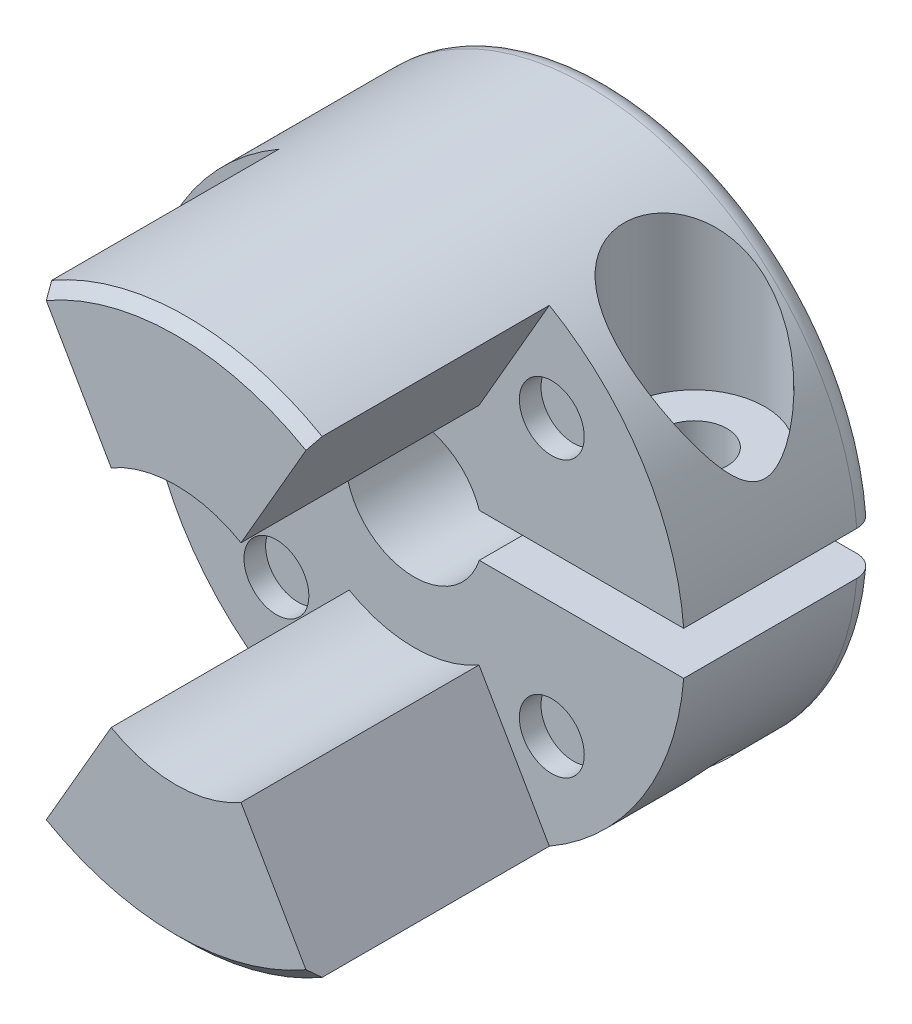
ISO-10303-21;
HEADER;
FILE_DESCRIPTION(('STEP AP214'),'2;1');
FILE_NAME('part.step','',(''),(''),'','','');
FILE_SCHEMA(('AUTOMOTIVE_DESIGN { 1 0 10303 214 1 1 1 1 }'));
ENDSEC;
DATA;
#1=APPLICATION_CONTEXT('core data for automotive mechanical design processes');
#2=APPLICATION_PROTOCOL_DEFINITION('international standard','automotive_design',2000,#1);
#3=PRODUCT_CONTEXT('',#1,'mechanical');
#4=PRODUCT('Part','Part','',(#3));
#5=PRODUCT_RELATED_PRODUCT_CATEGORY('part','',(#4));
#6=PRODUCT_DEFINITION_FORMATION('','',#4);
#7=PRODUCT_DEFINITION_CONTEXT('part definition',#1,'design');
#8=PRODUCT_DEFINITION('design','',#6,#7);
#9=PRODUCT_DEFINITION_SHAPE('','',#8);
#10=(LENGTH_UNIT() NAMED_UNIT(*) SI_UNIT(.MILLI.,.METRE.));
#11=(NAMED_UNIT(*) PLANE_ANGLE_UNIT() SI_UNIT($,.RADIAN.));
#12=(NAMED_UNIT(*) SI_UNIT($,.STERADIAN.) SOLID_ANGLE_UNIT());
#13=UNCERTAINTY_MEASURE_WITH_UNIT(LENGTH_MEASURE(1.E-05),#10,'distance_accuracy_value','');
#14=(GEOMETRIC_REPRESENTATION_CONTEXT(3) GLOBAL_UNCERTAINTY_ASSIGNED_CONTEXT((#13)) GLOBAL_UNIT_ASSIGNED_CONTEXT((#10,
#11,#12)) REPRESENTATION_CONTEXT('',''));
#15=CARTESIAN_POINT('',(0.,0.,0.));
#16=DIRECTION('',(0.,0.,1.));
#17=DIRECTION('',(1.,0.,0.));
#18=AXIS2_PLACEMENT_3D('',#15,#16,#17);
#19=CARTESIAN_POINT('',(8.45993579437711,4.,4.5));
#20=DIRECTION('',(0.,-1.,0.));
#21=DIRECTION('',(0.,0.,-1.));
#22=AXIS2_PLACEMENT_3D('',#19,#20,#21);
#23=PLANE('',#22);
#24=CARTESIAN_POINT('',(8.45993579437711,4.,4.5));
#25=DIRECTION('',(0.,-1.,0.));
#26=DIRECTION('',(0.,0.,-1.));
#27=AXIS2_PLACEMENT_3D('',#24,#25,#26);
#28=CIRCLE('',#27,3.25);
#29=CARTESIAN_POINT('',(8.45993579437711,4.,1.25));
#30=VERTEX_POINT('',#29);
#31=EDGE_CURVE('E476',#30,#30,#28,.F.);
#32=ORIENTED_EDGE('',*,*,#31,.T.);
#33=EDGE_LOOP('',(#32));
#34=FACE_BOUND('',#33,.T.);
#35=CARTESIAN_POINT('',(8.45993579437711,4.,4.5));
#36=DIRECTION('',(0.,1.,0.));
#37=DIRECTION('',(0.,0.,1.));
#38=AXIS2_PLACEMENT_3D('',#35,#36,#37);
#39=CIRCLE('',#38,1.5);
#40=CARTESIAN_POINT('',(8.45993579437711,4.,6.));
#41=VERTEX_POINT('',#40);
#42=EDGE_CURVE('E20',#41,#41,#39,.F.);
#43=ORIENTED_EDGE('',*,*,#42,.T.);
#44=EDGE_LOOP('',(#43));
#45=FACE_BOUND('',#44,.T.);
#46=ADVANCED_FACE('F17',(#34,#45),#23,.F.);
#47=CARTESIAN_POINT('',(6.36396103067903,6.36396103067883,8.));
#48=DIRECTION('',(0.,0.,1.));
#49=DIRECTION('',(1.,0.,0.));
#50=AXIS2_PLACEMENT_3D('',#47,#48,#49);
#51=PLANE('',#50);
#52=CARTESIAN_POINT('',(6.36396103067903,6.36396103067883,8.));
#53=DIRECTION('',(0.,0.,1.));
#54=DIRECTION('',(1.,0.,0.));
#55=AXIS2_PLACEMENT_3D('',#52,#53,#54);
#56=CIRCLE('',#55,1.5);
#57=CARTESIAN_POINT('',(7.86396103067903,6.36396103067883,8.));
#58=VERTEX_POINT('',#57);
#59=EDGE_CURVE('E713',#58,#58,#56,.T.);
#60=ORIENTED_EDGE('',*,*,#59,.T.);
#61=EDGE_LOOP('',(#60));
#62=FACE_BOUND('',#61,.T.);
#63=ADVANCED_FACE('F525',(#62),#51,.T.);
#64=CARTESIAN_POINT('',(-6.36396103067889,6.36396103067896,8.));
#65=DIRECTION('',(0.,0.,1.));
#66=DIRECTION('',(1.,0.,0.));
#67=AXIS2_PLACEMENT_3D('',#64,#65,#66);
#68=PLANE('',#67);
#69=CARTESIAN_POINT('',(-6.36396103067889,6.36396103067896,8.));
#70=DIRECTION('',(0.,0.,1.));
#71=DIRECTION('',(1.,0.,0.));
#72=AXIS2_PLACEMENT_3D('',#69,#70,#71);
#73=CIRCLE('',#72,1.5);
#74=CARTESIAN_POINT('',(-4.86396103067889,6.36396103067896,8.));
#75=VERTEX_POINT('',#74);
#76=EDGE_CURVE('E710',#75,#75,#73,.T.);
#77=ORIENTED_EDGE('',*,*,#76,.T.);
#78=EDGE_LOOP('',(#77));
#79=FACE_BOUND('',#78,.T.);
#80=ADVANCED_FACE('F518',(#79),#68,.T.);
#81=CARTESIAN_POINT('',(-6.36396103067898,-6.36396103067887,8.));
#82=DIRECTION('',(0.,0.,1.));
#83=DIRECTION('',(1.,0.,0.));
#84=AXIS2_PLACEMENT_3D('',#81,#82,#83);
#85=PLANE('',#84);
#86=CARTESIAN_POINT('',(-6.36396103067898,-6.36396103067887,8.));
#87=DIRECTION('',(0.,0.,1.));
#88=DIRECTION('',(1.,0.,0.));
#89=AXIS2_PLACEMENT_3D('',#86,#87,#88);
#90=CIRCLE('',#89,1.5);
#91=CARTESIAN_POINT('',(-4.86396103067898,-6.36396103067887,8.));
#92=VERTEX_POINT('',#91);
#93=EDGE_CURVE('E705',#92,#92,#90,.T.);
#94=ORIENTED_EDGE('',*,*,#93,.T.);
#95=EDGE_LOOP('',(#94));
#96=FACE_BOUND('',#95,.T.);
#97=ADVANCED_FACE('F511',(#96),#85,.T.);
#98=CARTESIAN_POINT('',(8.45993579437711,-12.501,4.5));
#99=DIRECTION('',(0.,1.,0.));
#100=DIRECTION('',(0.,0.,1.));
#101=AXIS2_PLACEMENT_3D('',#98,#99,#100);
#102=CYLINDRICAL_SURFACE('',#101,1.5);
#103=ORIENTED_EDGE('',*,*,#42,.F.);
#104=EDGE_LOOP('',(#103));
#105=FACE_BOUND('',#104,.T.);
#106=CARTESIAN_POINT('',(8.45993579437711,1.,4.5));
#107=DIRECTION('',(0.,1.,0.));
#108=DIRECTION('',(0.,0.,1.));
#109=AXIS2_PLACEMENT_3D('',#106,#107,#108);
#110=CIRCLE('',#109,1.5);
#111=CARTESIAN_POINT('',(8.45993579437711,1.,6.));
#112=VERTEX_POINT('',#111);
#113=EDGE_CURVE('E170',#112,#112,#110,.F.);
#114=ORIENTED_EDGE('',*,*,#113,.T.);
#115=EDGE_LOOP('',(#114));
#116=FACE_BOUND('',#115,.T.);
#117=ADVANCED_FACE('F306',(#105,#116),#102,.F.);
#118=CARTESIAN_POINT('',(0.,0.,0.));
#119=DIRECTION('',(0.,0.,-1.));
#120=DIRECTION('',(-1.,0.,0.));
#121=AXIS2_PLACEMENT_3D('',#118,#119,#120);
#122=CONICAL_SURFACE('',#121,3.67499999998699,0.785398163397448);
#123=CARTESIAN_POINT('',(0.,0.,0.500000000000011));
#124=DIRECTION('',(0.,0.,-1.));
#125=DIRECTION('',(-1.,0.,0.));
#126=AXIS2_PLACEMENT_3D('',#123,#124,#125);
#127=CIRCLE('',#126,3.175);
#128=CARTESIAN_POINT('',(3.01340753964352,1.,0.499999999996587));
#129=VERTEX_POINT('',#128);
#130=CARTESIAN_POINT('',(3.01340753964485,-1.,0.499999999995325));
#131=VERTEX_POINT('',#130);
#132=EDGE_CURVE('E145',#129,#131,#127,.F.);
#133=ORIENTED_EDGE('',*,*,#132,.T.);
#134=CARTESIAN_POINT('',(3.53632931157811,-1.,-3.00490254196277E-12));
#135=CARTESIAN_POINT('',(3.44946066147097,-1.,0.08363133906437));
#136=CARTESIAN_POINT('',(3.36244953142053,-1.,0.167113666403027));
#137=CARTESIAN_POINT('',(3.18814227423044,-1.,0.33378033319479));
#138=CARTESIAN_POINT('',(3.10084614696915,-1.,0.416964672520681));
#139=CARTESIAN_POINT('',(3.01340753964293,-1.,0.499999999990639));
#140=B_SPLINE_CURVE_WITH_KNOTS('',3,(#134,#135,#136,#137,#138,#139),.UNSPECIFIED.,.F.,.F.,(4,2,
4),(0.,0.361748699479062,0.723497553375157),.UNSPECIFIED.);
#141=CARTESIAN_POINT('',(3.53632931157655,-1.,-1.50251848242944E-12));
#142=VERTEX_POINT('',#141);
#143=EDGE_CURVE('E133',#142,#131,#140,.T.);
#144=ORIENTED_EDGE('',*,*,#143,.F.);
#145=CARTESIAN_POINT('',(0.,0.,0.));
#146=DIRECTION('',(0.,0.,-1.));
#147=DIRECTION('',(-1.,0.,0.));
#148=AXIS2_PLACEMENT_3D('',#145,#146,#147);
#149=CIRCLE('',#148,3.67499999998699);
#150=CARTESIAN_POINT('',(3.53632931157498,1.,0.));
#151=VERTEX_POINT('',#150);
#152=EDGE_CURVE('E127',#142,#151,#149,.T.);
#153=ORIENTED_EDGE('',*,*,#152,.T.);
#154=CARTESIAN_POINT('',(3.53632931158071,1.,-5.50815606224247E-12));
#155=CARTESIAN_POINT('',(3.4494606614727,1.,0.0836313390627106));
#156=CARTESIAN_POINT('',(3.36244953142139,1.,0.167113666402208));
#157=CARTESIAN_POINT('',(3.18814227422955,1.,0.333780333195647));
#158=CARTESIAN_POINT('',(3.10084614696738,1.,0.416964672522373));
#159=CARTESIAN_POINT('',(3.01340753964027,1.,0.499999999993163));
#160=B_SPLINE_CURVE_WITH_KNOTS('',3,(#154,#155,#156,#157,#158,#159),.UNSPECIFIED.,.F.,.F.,(4,2,
4),(0.,0.361748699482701,0.723497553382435),.UNSPECIFIED.);
#161=EDGE_CURVE('E148',#151,#129,#160,.T.);
#162=ORIENTED_EDGE('',*,*,#161,.T.);
#163=EDGE_LOOP('',(#133,#144,#153,#162));
#164=FACE_BOUND('',#163,.T.);
#165=ADVANCED_FACE('F146',(#164),#122,.F.);
#166=CARTESIAN_POINT('',(0.,0.,20.));
#167=DIRECTION('',(0.,0.,1.));
#168=DIRECTION('',(1.,0.,0.));
#169=AXIS2_PLACEMENT_3D('',#166,#167,#168);
#170=PLANE('',#169);
#171=CARTESIAN_POINT('',(0.,0.,20.));
#172=DIRECTION('',(0.,0.,-1.));
#173=DIRECTION('',(-1.,0.,0.));
#174=AXIS2_PLACEMENT_3D('',#171,#172,#173);
#175=CIRCLE('',#174,12.);
#176=CARTESIAN_POINT('',(-6.00000000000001,10.3923048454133,20.));
#177=VERTEX_POINT('',#176);
#178=CARTESIAN_POINT('',(6.00000000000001,10.3923048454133,20.));
#179=VERTEX_POINT('',#178);
#180=EDGE_CURVE('E143',#177,#179,#175,.T.);
#181=ORIENTED_EDGE('',*,*,#180,.F.);
#182=DIRECTION('',(0.500000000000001,-0.866025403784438,0.));
#183=VECTOR('',#182,1.);
#184=CARTESIAN_POINT('',(0.,0.,20.));
#185=LINE('',#184,#183);
#186=CARTESIAN_POINT('',(-3.,5.19615242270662,20.));
#187=VERTEX_POINT('',#186);
#188=EDGE_CURVE('E152',#187,#177,#185,.F.);
#189=ORIENTED_EDGE('',*,*,#188,.F.);
#190=CARTESIAN_POINT('',(0.,0.,20.));
#191=DIRECTION('',(0.,0.,1.));
#192=DIRECTION('',(1.,0.,0.));
#193=AXIS2_PLACEMENT_3D('',#190,#191,#192);
#194=CIRCLE('',#193,6.);
#195=CARTESIAN_POINT('',(3.,5.19615242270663,20.));
#196=VERTEX_POINT('',#195);
#197=EDGE_CURVE('E299',#187,#196,#194,.F.);
#198=ORIENTED_EDGE('',*,*,#197,.T.);
#199=DIRECTION('',(-0.500000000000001,-0.866025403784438,0.));
#200=VECTOR('',#199,1.);
#201=CARTESIAN_POINT('',(0.,0.,20.));
#202=LINE('',#201,#200);
#203=EDGE_CURVE('E386',#196,#179,#202,.F.);
#204=ORIENTED_EDGE('',*,*,#203,.T.);
#205=EDGE_LOOP('',(#181,#189,#198,#204));
#206=FACE_BOUND('',#205,.T.);
#207=ADVANCED_FACE('F305',(#206),#170,.T.);
#208=CARTESIAN_POINT('',(6.36396103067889,-6.36396103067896,8.));
#209=DIRECTION('',(0.,0.,1.));
#210=DIRECTION('',(1.,0.,0.));
#211=AXIS2_PLACEMENT_3D('',#208,#209,#210);
#212=PLANE('',#211);
#213=CARTESIAN_POINT('',(6.36396103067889,-6.36396103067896,8.));
#214=DIRECTION('',(0.,0.,1.));
#215=DIRECTION('',(1.,0.,0.));
#216=AXIS2_PLACEMENT_3D('',#213,#214,#215);
#217=CIRCLE('',#216,1.5);
#218=CARTESIAN_POINT('',(7.86396103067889,-6.36396103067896,8.));
#219=VERTEX_POINT('',#218);
#220=EDGE_CURVE('E397',#219,#219,#217,.T.);
#221=ORIENTED_EDGE('',*,*,#220,.T.);
#222=EDGE_LOOP('',(#221));
#223=FACE_BOUND('',#222,.T.);
#224=ADVANCED_FACE('F490',(#223),#212,.T.);
#225=CARTESIAN_POINT('',(0.,0.,19.5));
#226=DIRECTION('',(0.,0.,-1.));
#227=DIRECTION('',(-1.,0.,0.));
#228=AXIS2_PLACEMENT_3D('',#225,#226,#227);
#229=CONICAL_SURFACE('',#228,12.5,0.785398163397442);
#230=DIRECTION('',(-0.353553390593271,0.612372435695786,-0.707106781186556));
#231=VECTOR('',#230,1.);
#232=CARTESIAN_POINT('',(-6.00000000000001,10.3923048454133,20.));
#233=LINE('',#232,#231);
#234=CARTESIAN_POINT('',(-6.25000000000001,10.8253175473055,19.5));
#235=VERTEX_POINT('',#234);
#236=EDGE_CURVE('E390',#177,#235,#233,.T.);
#237=ORIENTED_EDGE('',*,*,#236,.F.);
#238=ORIENTED_EDGE('',*,*,#180,.T.);
#239=DIRECTION('',(0.353553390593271,0.612372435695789,-0.707106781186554));
#240=VECTOR('',#239,1.);
#241=CARTESIAN_POINT('',(6.00000000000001,10.3923048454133,20.));
#242=LINE('',#241,#240);
#243=CARTESIAN_POINT('',(6.25000000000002,10.8253175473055,19.5));
#244=VERTEX_POINT('',#243);
#245=EDGE_CURVE('E387',#179,#244,#242,.T.);
#246=ORIENTED_EDGE('',*,*,#245,.T.);
#247=CARTESIAN_POINT('',(0.,0.,19.5));
#248=DIRECTION('',(0.,0.,-1.));
#249=DIRECTION('',(-1.,0.,0.));
#250=AXIS2_PLACEMENT_3D('',#247,#248,#249);
#251=CIRCLE('',#250,12.5);
#252=EDGE_CURVE('E176',#235,#244,#251,.T.);
#253=ORIENTED_EDGE('',*,*,#252,.F.);
#254=EDGE_LOOP('',(#237,#238,#246,#253));
#255=FACE_BOUND('',#254,.T.);
#256=ADVANCED_FACE('F206',(#255),#229,.T.);
#257=CARTESIAN_POINT('',(8.45993579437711,12.5,4.5));
#258=DIRECTION('',(0.,-1.,0.));
#259=DIRECTION('',(0.,0.,-1.));
#260=AXIS2_PLACEMENT_3D('',#257,#258,#259);
#261=CYLINDRICAL_SURFACE('',#260,3.25);
#262=ORIENTED_EDGE('',*,*,#31,.F.);
#263=EDGE_LOOP('',(#262));
#264=FACE_BOUND('',#263,.T.);
#265=CARTESIAN_POINT('',(8.45993579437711,9.20214574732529,7.75));
#266=CARTESIAN_POINT('',(8.35821897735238,9.29565821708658,7.74999972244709));
#267=CARTESIAN_POINT('',(8.25494097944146,9.38748858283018,7.74522625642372));
#268=CARTESIAN_POINT('',(8.04598618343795,9.56718824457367,7.72523800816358));
#269=CARTESIAN_POINT('',(7.94030986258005,9.65505831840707,7.71002528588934));
#270=CARTESIAN_POINT('',(7.72749590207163,9.82621121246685,7.66824494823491));
#271=CARTESIAN_POINT('',(7.62035868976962,9.9094953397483,7.64168058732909));
#272=CARTESIAN_POINT('',(7.40591408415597,10.0707730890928,7.57638048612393));
#273=CARTESIAN_POINT('',(7.29860678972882,10.1487690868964,7.53765025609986));
#274=CARTESIAN_POINT('',(7.03686498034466,10.3328714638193,7.42670784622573));
#275=CARTESIAN_POINT('',(6.88305827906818,10.4357437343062,7.34727475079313));
#276=CARTESIAN_POINT('',(6.65895554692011,10.5790490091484,7.20680258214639));
#277=CARTESIAN_POINT('',(6.5853393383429,10.624993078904,7.15641042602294));
#278=CARTESIAN_POINT('',(6.44110431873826,10.7130425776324,7.04851214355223));
#279=CARTESIAN_POINT('',(6.37048409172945,10.7551498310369,6.9910094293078));
#280=CARTESIAN_POINT('',(6.2326296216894,10.8356242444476,6.86857922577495));
#281=CARTESIAN_POINT('',(6.16542240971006,10.8739632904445,6.80360277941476));
#282=CARTESIAN_POINT('',(6.03586823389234,10.9464057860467,6.66685512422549));
#283=CARTESIAN_POINT('',(5.97351904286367,10.9805111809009,6.5950870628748));
#284=CARTESIAN_POINT('',(5.85454810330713,11.0444026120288,6.44515148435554));
#285=CARTESIAN_POINT('',(5.79792661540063,11.0741884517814,6.36698367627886));
#286=CARTESIAN_POINT('',(5.69127349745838,11.1293761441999,6.204823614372));
#287=CARTESIAN_POINT('',(5.64124110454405,11.1547785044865,6.12083203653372));
#288=CARTESIAN_POINT('',(5.55353632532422,11.1986773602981,5.95705817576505));
#289=CARTESIAN_POINT('',(5.51511306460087,11.217623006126,5.87779716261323));
#290=CARTESIAN_POINT('',(5.44459450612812,11.2520189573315,5.71574190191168));
#291=CARTESIAN_POINT('',(5.41250132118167,11.2674680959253,5.63294648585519));
#292=CARTESIAN_POINT('',(5.3550891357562,11.2948676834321,5.46453697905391));
#293=CARTESIAN_POINT('',(5.32976537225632,11.3068205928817,5.37892491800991));
#294=CARTESIAN_POINT('',(5.28617367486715,11.3272651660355,5.20551016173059));
#295=CARTESIAN_POINT('',(5.26790825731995,11.3357555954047,5.11770669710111));
#296=CARTESIAN_POINT('',(5.22590123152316,11.3552171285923,4.86302109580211));
#297=CARTESIAN_POINT('',(5.21135213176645,11.3618584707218,4.69416884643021));
#298=CARTESIAN_POINT('',(5.2087155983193,11.3630659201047,4.35632654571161));
#299=CARTESIAN_POINT('',(5.22062360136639,11.3576341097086,4.18733652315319));
#300=CARTESIAN_POINT('',(5.26993344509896,11.3348363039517,3.85667080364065));
#301=CARTESIAN_POINT('',(5.30693134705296,11.3176593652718,3.69492186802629));
#302=CARTESIAN_POINT('',(5.40440504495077,11.2714369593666,3.38047669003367));
#303=CARTESIAN_POINT('',(5.46488016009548,11.2423918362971,3.22778018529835));
#304=CARTESIAN_POINT('',(5.60748178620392,11.1719518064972,2.93379875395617));
#305=CARTESIAN_POINT('',(5.68983896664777,11.1304246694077,2.79265770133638));
#306=CARTESIAN_POINT('',(5.87232738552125,11.0352314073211,2.52698978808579));
#307=CARTESIAN_POINT('',(5.97246015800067,10.981564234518,2.40246436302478));
#308=CARTESIAN_POINT('',(6.19121687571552,10.8597953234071,2.16711092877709));
#309=CARTESIAN_POINT('',(6.31046922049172,10.7911536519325,2.05714901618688));
#310=CARTESIAN_POINT('',(6.55909725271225,10.6418643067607,1.85905038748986));
#311=CARTESIAN_POINT('',(6.68847684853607,10.561211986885,1.77092215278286));
#312=CARTESIAN_POINT('',(6.9662448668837,10.3803453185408,1.60866526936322));
#313=CARTESIAN_POINT('',(7.11523108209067,10.2789768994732,1.5368597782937));
#314=CARTESIAN_POINT('',(7.41493103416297,10.064926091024,1.41836655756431));
#315=CARTESIAN_POINT('',(7.56564513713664,9.95224126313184,1.37168425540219));
#316=CARTESIAN_POINT('',(7.84201168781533,9.7354435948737,1.30662647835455));
#317=CARTESIAN_POINT('',(7.96797145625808,9.63265590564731,1.28501348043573));
#318=CARTESIAN_POINT('',(8.21666397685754,9.42141389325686,1.25670286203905));
#319=CARTESIAN_POINT('',(8.33939768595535,9.31296127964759,1.250000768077));
#320=CARTESIAN_POINT('',(8.58766118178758,9.08472266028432,1.24999918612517));
#321=CARTESIAN_POINT('',(8.71292132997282,8.96464646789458,1.25752267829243));
#322=CARTESIAN_POINT('',(8.95762699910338,8.72014139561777,1.28597018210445));
#323=CARTESIAN_POINT('',(9.07706884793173,8.59570984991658,1.30690254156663));
#324=CARTESIAN_POINT('',(9.30986513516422,8.34302266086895,1.36082076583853));
#325=CARTESIAN_POINT('',(9.42319713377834,8.21475529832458,1.39384799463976));
#326=CARTESIAN_POINT('',(9.6429538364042,7.95564627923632,1.47072334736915));
#327=CARTESIAN_POINT('',(9.74937946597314,7.82480497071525,1.51457001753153));
#328=CARTESIAN_POINT('',(9.98152669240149,7.52749667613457,1.62463305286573));
#329=CARTESIAN_POINT('',(10.1052088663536,7.36048832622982,1.69370251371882));
#330=CARTESIAN_POINT('',(10.3412895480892,7.0249453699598,1.84617814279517));
#331=CARTESIAN_POINT('',(10.4536815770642,6.8564099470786,1.92959246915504));
#332=CARTESIAN_POINT('',(10.6670773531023,6.51944674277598,2.11031221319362));
#333=CARTESIAN_POINT('',(10.7680781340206,6.35101900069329,2.20762123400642));
#334=CARTESIAN_POINT('',(10.9107941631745,6.10031445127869,2.36440510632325));
#335=CARTESIAN_POINT('',(10.9568902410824,6.01709226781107,2.41845305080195));
#336=CARTESIAN_POINT('',(11.0461198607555,5.85167120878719,2.53041095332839));
#337=CARTESIAN_POINT('',(11.089253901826,5.76947216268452,2.58832025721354));
#338=CARTESIAN_POINT('',(11.1715290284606,5.6084691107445,2.70699773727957));
#339=CARTESIAN_POINT('',(11.2107385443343,5.52963039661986,2.76767113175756));
#340=CARTESIAN_POINT('',(11.2860938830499,5.37415476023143,2.89354049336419));
#341=CARTESIAN_POINT('',(11.3222407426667,5.29751709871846,2.95873491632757));
#342=CARTESIAN_POINT('',(11.39108980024,5.14779839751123,3.09409127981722));
#343=CARTESIAN_POINT('',(11.4238067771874,5.07470289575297,3.16422952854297));
#344=CARTESIAN_POINT('',(11.4855505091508,4.93336129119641,3.31068412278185));
#345=CARTESIAN_POINT('',(11.5145811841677,4.86511007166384,3.38699376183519));
#346=CARTESIAN_POINT('',(11.5631833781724,4.74826365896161,3.53199378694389));
#347=CARTESIAN_POINT('',(11.5835051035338,4.69839378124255,3.59939042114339));
#348=CARTESIAN_POINT('',(11.6206651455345,4.60571730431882,3.74001017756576));
#349=CARTESIAN_POINT('',(11.6374992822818,4.56291919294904,3.81324014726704));
#350=CARTESIAN_POINT('',(11.6669140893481,4.48718124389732,3.96707654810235));
#351=CARTESIAN_POINT('',(11.6794252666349,4.45440336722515,4.04777920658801));
#352=CARTESIAN_POINT('',(11.698437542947,4.40423818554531,4.21442004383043));
#353=CARTESIAN_POINT('',(11.7049624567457,4.3867899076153,4.30033601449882));
#354=CARTESIAN_POINT('',(11.7106387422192,4.37161297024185,4.46386054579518));
#355=CARTESIAN_POINT('',(11.7105748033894,4.37178573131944,4.54124178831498));
#356=CARTESIAN_POINT('',(11.7050225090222,4.38662750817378,4.69444310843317));
#357=CARTESIAN_POINT('',(11.6995262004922,4.40131777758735,4.7702607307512));
#358=CARTESIAN_POINT('',(11.6827069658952,4.44578212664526,4.92830871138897));
#359=CARTESIAN_POINT('',(11.6706682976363,4.47739982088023,5.00992375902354));
#360=CARTESIAN_POINT('',(11.6417891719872,4.55195933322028,5.16687100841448));
#361=CARTESIAN_POINT('',(11.624937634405,4.59492726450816,5.24218818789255));
#362=CARTESIAN_POINT('',(11.589096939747,4.68454554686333,5.38063438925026));
#363=CARTESIAN_POINT('',(11.5704101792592,4.73057476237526,5.44425536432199));
#364=CARTESIAN_POINT('',(11.5304348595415,4.8271947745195,5.56710418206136));
#365=CARTESIAN_POINT('',(11.5091439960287,4.87778960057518,5.62632805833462));
#366=CARTESIAN_POINT('',(11.4642791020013,4.98232354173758,5.741057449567));
#367=CARTESIAN_POINT('',(11.440700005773,5.03626997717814,5.79655423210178));
#368=CARTESIAN_POINT('',(11.3915219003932,5.14654116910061,5.90420746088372));
#369=CARTESIAN_POINT('',(11.3659221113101,5.20286683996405,5.95636260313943));
#370=CARTESIAN_POINT('',(11.2810020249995,5.38592328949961,6.1186418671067));
#371=CARTESIAN_POINT('',(11.2181049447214,5.51597484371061,6.2231668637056));
#372=CARTESIAN_POINT('',(11.0841656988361,5.78042831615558,6.42097642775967));
#373=CARTESIAN_POINT('',(11.0131151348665,5.9148346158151,6.51424919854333));
#374=CARTESIAN_POINT('',(10.8631139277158,6.18601667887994,6.69104753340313));
#375=CARTESIAN_POINT('',(10.7841501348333,6.32279606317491,6.77455635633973));
#376=CARTESIAN_POINT('',(10.6185712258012,6.59709241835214,6.93225338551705));
#377=CARTESIAN_POINT('',(10.531955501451,6.73460944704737,7.00644084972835));
#378=CARTESIAN_POINT('',(10.341891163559,7.02339938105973,7.15264986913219));
#379=CARTESIAN_POINT('',(10.2376269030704,7.17464200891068,7.22367545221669));
#380=CARTESIAN_POINT('',(10.0199127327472,7.47568521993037,7.35395594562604));
#381=CARTESIAN_POINT('',(9.90645970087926,7.62548529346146,7.4132068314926));
#382=CARTESIAN_POINT('',(9.67104186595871,7.92190783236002,7.51865655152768));
#383=CARTESIAN_POINT('',(9.54911459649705,8.0685409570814,7.56490887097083));
#384=CARTESIAN_POINT('',(9.29672331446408,8.35809574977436,7.64320306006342));
#385=CARTESIAN_POINT('',(9.16626584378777,8.50102014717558,7.67525567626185));
#386=CARTESIAN_POINT('',(8.94007689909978,8.73742923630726,7.71568841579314));
#387=CARTESIAN_POINT('',(8.84645681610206,8.83221541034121,7.72835248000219));
#388=CARTESIAN_POINT('',(8.65569538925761,9.0192458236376,7.74551416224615));
#389=CARTESIAN_POINT('',(8.55854927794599,9.11148630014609,7.7500002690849));
#390=CARTESIAN_POINT('',(8.45993579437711,9.20214574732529,7.75));
#391=B_SPLINE_CURVE_WITH_KNOTS('',3,(#265,#266,#267,#268,#269,#270,#271,#272,#273,#274,#275,
#276,#277,#278,#279,#280,#281,#282,#283,#284,#285,#286,#287,#288,#289,#290,#291,#292,#293,#294,
#295,#296,#297,#298,#299,#300,#301,#302,#303,#304,#305,#306,#307,#308,#309,#310,#311,#312,#313,
#314,#315,#316,#317,#318,#319,#320,#321,#322,#323,#324,#325,#326,#327,#328,#329,#330,#331,#332,
#333,#334,#335,#336,#337,#338,#339,#340,#341,#342,#343,#344,#345,#346,#347,#348,#349,#350,#351,
#352,#353,#354,#355,#356,#357,#358,#359,#360,#361,#362,#363,#364,#365,#366,#367,#368,#369,#370,
#371,#372,#373,#374,#375,#376,#377,#378,#379,#380,#381,#382,#383,#384,#385,#386,#387,#388,#389,
#390),.UNSPECIFIED.,.T.,.F.,(4,2,2,2,2,2,2,2,2,2,2,2,2,2,2,2,2,2,2,2,2,2,2,2,2,2,2,2,2,2,2,2,2,
2,2,2,2,2,2,2,2,2,2,2,2,2,2,2,2,2,2,2,2,2,2,2,2,2,2,2,2,2,4),(0.,0.414407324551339,
0.828732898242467,1.24293976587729,1.65695929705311,2.25816551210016,2.55890996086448,
2.85951064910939,3.16220652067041,3.46476279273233,3.7673328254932,4.06986779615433,
4.33981172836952,4.60984560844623,4.87968898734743,5.14962847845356,5.65576212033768,
6.16180847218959,6.65989521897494,7.15796752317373,7.66151425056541,8.16510445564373,
8.69130663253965,9.21771289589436,9.7974549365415,10.3773221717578,10.8684959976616,
11.359522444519,11.879827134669,12.4004560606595,12.9228824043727,13.4452385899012,
14.1013844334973,14.757904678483,15.4145954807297,15.7427561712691,16.0708614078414,
16.3915159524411,16.7120615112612,17.0311635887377,17.3499234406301,17.6083186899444,
17.8670218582,18.1297089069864,18.3913463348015,18.6218652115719,18.8527220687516,
19.1163167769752,19.3805232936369,19.6223279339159,19.8643481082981,20.106916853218,
20.3495796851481,20.8836489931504,21.4182734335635,21.9538014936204,22.4893721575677,
23.0796701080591,23.6701694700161,24.2582022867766,24.8457893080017,25.2469889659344,
25.6487529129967),.UNSPECIFIED.);
#392=CARTESIAN_POINT('',(8.45993579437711,9.20214574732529,7.75));
#393=VERTEX_POINT('',#392);
#394=EDGE_CURVE('E181',#393,#393,#391,.T.);
#395=ORIENTED_EDGE('',*,*,#394,.F.);
#396=EDGE_LOOP('',(#395));
#397=FACE_BOUND('',#396,.T.);
#398=ADVANCED_FACE('F201',(#264,#397),#261,.F.);
#399=CARTESIAN_POINT('',(0.,0.,0.));
#400=DIRECTION('',(0.,0.,1.));
#401=DIRECTION('',(1.,0.,0.));
#402=AXIS2_PLACEMENT_3D('',#399,#400,#401);
#403=PLANE('',#402);
#404=ORIENTED_EDGE('',*,*,#152,.F.);
#405=DIRECTION('',(1.,0.,0.));
#406=VECTOR('',#405,1.);
#407=CARTESIAN_POINT('',(1.,-1.,0.));
#408=LINE('',#407,#406);
#409=CARTESIAN_POINT('',(11.4564392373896,-1.,0.));
#410=VERTEX_POINT('',#409);
#411=EDGE_CURVE('E141',#142,#410,#408,.T.);
#412=ORIENTED_EDGE('',*,*,#411,.T.);
#413=CARTESIAN_POINT('',(0.,0.,0.));
#414=DIRECTION('',(0.,0.,1.));
#415=DIRECTION('',(0.996212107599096,0.0869565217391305,0.));
#416=AXIS2_PLACEMENT_3D('',#413,#414,#415);
#417=CIRCLE('',#416,11.5);
#418=CARTESIAN_POINT('',(11.4564392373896,1.,0.));
#419=VERTEX_POINT('',#418);
#420=EDGE_CURVE('E184',#419,#410,#417,.T.);
#421=ORIENTED_EDGE('',*,*,#420,.F.);
#422=DIRECTION('',(1.,0.,0.));
#423=VECTOR('',#422,1.);
#424=CARTESIAN_POINT('',(1.,1.,0.));
#425=LINE('',#424,#423);
#426=EDGE_CURVE('E168',#419,#151,#425,.F.);
#427=ORIENTED_EDGE('',*,*,#426,.T.);
#428=EDGE_LOOP('',(#404,#412,#421,#427));
#429=FACE_BOUND('',#428,.T.);
#430=ADVANCED_FACE('F190',(#429),#403,.F.);
#431=CARTESIAN_POINT('',(6.36396103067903,6.36396103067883,8.));
#432=DIRECTION('',(0.,0.,1.));
#433=DIRECTION('',(1.,0.,0.));
#434=AXIS2_PLACEMENT_3D('',#431,#432,#433);
#435=CYLINDRICAL_SURFACE('',#434,1.5);
#436=ORIENTED_EDGE('',*,*,#59,.F.);
#437=EDGE_LOOP('',(#436));
#438=FACE_BOUND('',#437,.T.);
#439=CARTESIAN_POINT('',(6.36396103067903,6.36396103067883,9.));
#440=DIRECTION('',(0.,0.,1.));
#441=DIRECTION('',(1.,0.,0.));
#442=AXIS2_PLACEMENT_3D('',#439,#440,#441);
#443=CIRCLE('',#442,1.5);
#444=CARTESIAN_POINT('',(7.86396103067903,6.36396103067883,9.));
#445=VERTEX_POINT('',#444);
#446=EDGE_CURVE('E159',#445,#445,#443,.T.);
#447=ORIENTED_EDGE('',*,*,#446,.T.);
#448=EDGE_LOOP('',(#447));
#449=FACE_BOUND('',#448,.T.);
#450=ADVANCED_FACE('F200',(#438,#449),#435,.F.);
#451=CARTESIAN_POINT('',(-6.36396103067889,6.36396103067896,8.));
#452=DIRECTION('',(0.,0.,1.));
#453=DIRECTION('',(1.,0.,0.));
#454=AXIS2_PLACEMENT_3D('',#451,#452,#453);
#455=CYLINDRICAL_SURFACE('',#454,1.5);
#456=ORIENTED_EDGE('',*,*,#76,.F.);
#457=EDGE_LOOP('',(#456));
#458=FACE_BOUND('',#457,.T.);
#459=CARTESIAN_POINT('',(-6.36396103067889,6.36396103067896,9.));
#460=DIRECTION('',(0.,0.,1.));
#461=DIRECTION('',(1.,0.,0.));
#462=AXIS2_PLACEMENT_3D('',#459,#460,#461);
#463=CIRCLE('',#462,1.5);
#464=CARTESIAN_POINT('',(-4.86396103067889,6.36396103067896,9.));
#465=VERTEX_POINT('',#464);
#466=EDGE_CURVE('E452',#465,#465,#463,.T.);
#467=ORIENTED_EDGE('',*,*,#466,.T.);
#468=EDGE_LOOP('',(#467));
#469=FACE_BOUND('',#468,.T.);
#470=ADVANCED_FACE('F584',(#458,#469),#455,.F.);
#471=CARTESIAN_POINT('',(-6.36396103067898,-6.36396103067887,8.));
#472=DIRECTION('',(0.,0.,1.));
#473=DIRECTION('',(1.,0.,0.));
#474=AXIS2_PLACEMENT_3D('',#471,#472,#473);
#475=CYLINDRICAL_SURFACE('',#474,1.5);
#476=ORIENTED_EDGE('',*,*,#93,.F.);
#477=EDGE_LOOP('',(#476));
#478=FACE_BOUND('',#477,.T.);
#479=CARTESIAN_POINT('',(-6.36396103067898,-6.36396103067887,9.));
#480=DIRECTION('',(0.,0.,1.));
#481=DIRECTION('',(1.,0.,0.));
#482=AXIS2_PLACEMENT_3D('',#479,#480,#481);
#483=CIRCLE('',#482,1.5);
#484=CARTESIAN_POINT('',(-4.86396103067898,-6.36396103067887,9.));
#485=VERTEX_POINT('',#484);
#486=EDGE_CURVE('E448',#485,#485,#483,.T.);
#487=ORIENTED_EDGE('',*,*,#486,.T.);
#488=EDGE_LOOP('',(#487));
#489=FACE_BOUND('',#488,.T.);
#490=ADVANCED_FACE('F288',(#478,#489),#475,.F.);
#491=CARTESIAN_POINT('',(1.,1.,0.));
#492=DIRECTION('',(0.,1.,0.));
#493=DIRECTION('',(0.,0.,1.));
#494=AXIS2_PLACEMENT_3D('',#491,#492,#493);
#495=PLANE('',#494);
#496=ORIENTED_EDGE('',*,*,#161,.F.);
#497=ORIENTED_EDGE('',*,*,#426,.F.);
#498=CARTESIAN_POINT('',(12.4599357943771,1.,1.));
#499=CARTESIAN_POINT('',(12.4599356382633,1.,0.97193237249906));
#500=CARTESIAN_POINT('',(12.458749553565,1.,0.943878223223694));
#501=CARTESIAN_POINT('',(12.4540180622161,1.,0.887971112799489));
#502=CARTESIAN_POINT('',(12.4504727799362,1.,0.860118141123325));
#503=CARTESIAN_POINT('',(12.4363331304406,1.,0.777213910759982));
#504=CARTESIAN_POINT('',(12.4222348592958,1.,0.722718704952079));
#505=CARTESIAN_POINT('',(12.3850929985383,1.,0.616871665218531));
#506=CARTESIAN_POINT('',(12.3620453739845,1.,0.565521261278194));
#507=CARTESIAN_POINT('',(12.3076678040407,1.,0.467411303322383));
#508=CARTESIAN_POINT('',(12.2763391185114,1.,0.420651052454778));
#509=CARTESIAN_POINT('',(12.2062539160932,1.,0.332977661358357));
#510=CARTESIAN_POINT('',(12.1674868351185,1.,0.29207298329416));
#511=CARTESIAN_POINT('',(12.0836282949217,1.,0.217315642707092));
#512=CARTESIAN_POINT('',(12.0385367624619,1.,0.183463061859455));
#513=CARTESIAN_POINT('',(11.9670943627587,1.,0.138656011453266));
#514=CARTESIAN_POINT('',(11.942584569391,1.,0.124690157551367));
#515=CARTESIAN_POINT('',(11.8925032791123,1.,0.098877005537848));
#516=CARTESIAN_POINT('',(11.8669327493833,1.,0.0870278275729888));
#517=CARTESIAN_POINT('',(11.7888639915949,1.,0.0547755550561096));
#518=CARTESIAN_POINT('',(11.7349617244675,1.,0.0376383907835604));
#519=CARTESIAN_POINT('',(11.6433732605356,1.,0.016777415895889));
#520=CARTESIAN_POINT('',(11.6062406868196,1.,0.0104897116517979));
#521=CARTESIAN_POINT('',(11.5315591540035,0.999999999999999,0.00210262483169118));
#522=CARTESIAN_POINT('',(11.4940108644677,0.999999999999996,-2.71982559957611E-06));
#523=CARTESIAN_POINT('',(11.4564392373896,0.99999999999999,0.));
#524=B_SPLINE_CURVE_WITH_KNOTS('',3,(#498,#499,#500,#501,#502,#503,#504,#505,#506,#507,#508,
#509,#510,#511,#512,#513,#514,#515,#516,#517,#518,#519,#520,#521,#522,#523),.UNSPECIFIED.,.F.,
.F.,(4,2,2,2,2,2,2,2,2,2,2,2,4),(0.,0.084151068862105,0.168297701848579,0.336298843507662,
0.504375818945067,0.672427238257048,0.840719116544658,1.009012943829,1.09355406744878,
1.17801973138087,1.34678722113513,1.45955810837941,1.57216812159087),.UNSPECIFIED.);
#525=CARTESIAN_POINT('',(12.4599357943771,1.,1.));
#526=VERTEX_POINT('',#525);
#527=EDGE_CURVE('E217',#526,#419,#524,.T.);
#528=ORIENTED_EDGE('',*,*,#527,.F.);
#529=DIRECTION('',(0.,0.,-1.));
#530=VECTOR('',#529,1.);
#531=CARTESIAN_POINT('',(12.4599357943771,0.999999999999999,20.));
#532=LINE('',#531,#530);
#533=CARTESIAN_POINT('',(12.4599357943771,1.,9.));
#534=VERTEX_POINT('',#533);
#535=EDGE_CURVE('E175',#534,#526,#532,.T.);
#536=ORIENTED_EDGE('',*,*,#535,.F.);
#537=DIRECTION('',(-1.,0.,0.));
#538=VECTOR('',#537,1.);
#539=CARTESIAN_POINT('',(0.,1.,9.));
#540=LINE('',#539,#538);
#541=CARTESIAN_POINT('',(3.01340753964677,1.,9.));
#542=VERTEX_POINT('',#541);
#543=EDGE_CURVE('E443',#534,#542,#540,.T.);
#544=ORIENTED_EDGE('',*,*,#543,.T.);
#545=DIRECTION('',(0.,0.,-1.));
#546=VECTOR('',#545,1.);
#547=CARTESIAN_POINT('',(3.01340753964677,1.,20.));
#548=LINE('',#547,#546);
#549=EDGE_CURVE('E153',#542,#129,#548,.T.);
#550=ORIENTED_EDGE('',*,*,#549,.T.);
#551=EDGE_LOOP('',(#496,#497,#528,#536,#544,#550));
#552=FACE_BOUND('',#551,.T.);
#553=ORIENTED_EDGE('',*,*,#113,.F.);
#554=EDGE_LOOP('',(#553));
#555=FACE_BOUND('',#554,.T.);
#556=ADVANCED_FACE('F284',(#552,#555),#495,.F.);
#557=CARTESIAN_POINT('',(0.,0.,20.));
#558=DIRECTION('',(0.,0.,-1.));
#559=DIRECTION('',(-1.,0.,0.));
#560=AXIS2_PLACEMENT_3D('',#557,#558,#559);
#561=CYLINDRICAL_SURFACE('',#560,3.175);
#562=CARTESIAN_POINT('',(0.,0.,9.));
#563=DIRECTION('',(0.,0.,-1.));
#564=DIRECTION('',(-1.,0.,0.));
#565=AXIS2_PLACEMENT_3D('',#562,#563,#564);
#566=CIRCLE('',#565,3.175);
#567=CARTESIAN_POINT('',(3.01340753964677,-1.,9.));
#568=VERTEX_POINT('',#567);
#569=EDGE_CURVE('E156',#542,#568,#566,.F.);
#570=ORIENTED_EDGE('',*,*,#569,.T.);
#571=DIRECTION('',(0.,0.,-1.));
#572=VECTOR('',#571,1.);
#573=CARTESIAN_POINT('',(3.01340753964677,-1.,0.));
#574=LINE('',#573,#572);
#575=EDGE_CURVE('E138',#568,#131,#574,.T.);
#576=ORIENTED_EDGE('',*,*,#575,.T.);
#577=ORIENTED_EDGE('',*,*,#132,.F.);
#578=ORIENTED_EDGE('',*,*,#549,.F.);
#579=EDGE_LOOP('',(#570,#576,#577,#578));
#580=FACE_BOUND('',#579,.T.);
#581=ADVANCED_FACE('F155',(#580),#561,.F.);
#582=CARTESIAN_POINT('',(0.,0.,9.));
#583=DIRECTION('',(-0.866025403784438,-0.500000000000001,0.));
#584=DIRECTION('',(0.500000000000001,-0.866025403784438,0.));
#585=AXIS2_PLACEMENT_3D('',#582,#583,#584);
#586=PLANE('',#585);
#587=DIRECTION('',(0.,0.,-1.));
#588=VECTOR('',#587,1.);
#589=CARTESIAN_POINT('',(-6.25000000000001,10.8253175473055,20.));
#590=LINE('',#589,#588);
#591=CARTESIAN_POINT('',(-6.25000000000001,10.8253175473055,9.));
#592=VERTEX_POINT('',#591);
#593=EDGE_CURVE('E391',#592,#235,#590,.F.);
#594=ORIENTED_EDGE('',*,*,#593,.F.);
#595=DIRECTION('',(0.500000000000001,-0.866025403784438,0.));
#596=VECTOR('',#595,1.);
#597=CARTESIAN_POINT('',(-6.25000000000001,10.8253175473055,9.));
#598=LINE('',#597,#596);
#599=CARTESIAN_POINT('',(-3.,5.19615242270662,9.));
#600=VERTEX_POINT('',#599);
#601=EDGE_CURVE('E433',#592,#600,#598,.T.);
#602=ORIENTED_EDGE('',*,*,#601,.T.);
#603=DIRECTION('',(0.,0.,1.));
#604=VECTOR('',#603,1.);
#605=CARTESIAN_POINT('',(-3.,5.19615242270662,-7.97056274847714));
#606=LINE('',#605,#604);
#607=EDGE_CURVE('E388',#600,#187,#606,.T.);
#608=ORIENTED_EDGE('',*,*,#607,.T.);
#609=ORIENTED_EDGE('',*,*,#188,.T.);
#610=ORIENTED_EDGE('',*,*,#236,.T.);
#611=EDGE_LOOP('',(#594,#602,#608,#609,#610));
#612=FACE_BOUND('',#611,.T.);
#613=ADVANCED_FACE('F278',(#612),#586,.T.);
#614=CARTESIAN_POINT('',(0.,0.,-7.97056274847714));
#615=DIRECTION('',(0.,0.,1.));
#616=DIRECTION('',(1.,0.,0.));
#617=AXIS2_PLACEMENT_3D('',#614,#615,#616);
#618=CYLINDRICAL_SURFACE('',#617,6.);
#619=ORIENTED_EDGE('',*,*,#607,.F.);
#620=CARTESIAN_POINT('',(0.,0.,9.));
#621=DIRECTION('',(0.,0.,1.));
#622=DIRECTION('',(1.,0.,0.));
#623=AXIS2_PLACEMENT_3D('',#620,#621,#622);
#624=CIRCLE('',#623,6.);
#625=CARTESIAN_POINT('',(3.,5.19615242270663,9.));
#626=VERTEX_POINT('',#625);
#627=EDGE_CURVE('E435',#600,#626,#624,.F.);
#628=ORIENTED_EDGE('',*,*,#627,.T.);
#629=DIRECTION('',(0.,0.,1.));
#630=VECTOR('',#629,1.);
#631=CARTESIAN_POINT('',(3.,5.19615242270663,9.));
#632=LINE('',#631,#630);
#633=EDGE_CURVE('E383',#626,#196,#632,.T.);
#634=ORIENTED_EDGE('',*,*,#633,.T.);
#635=ORIENTED_EDGE('',*,*,#197,.F.);
#636=EDGE_LOOP('',(#619,#628,#634,#635));
#637=FACE_BOUND('',#636,.T.);
#638=ADVANCED_FACE('F274',(#637),#618,.F.);
#639=CARTESIAN_POINT('',(0.,0.,9.));
#640=DIRECTION('',(-0.866025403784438,0.500000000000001,0.));
#641=DIRECTION('',(-0.500000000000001,-0.866025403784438,0.));
#642=AXIS2_PLACEMENT_3D('',#639,#640,#641);
#643=PLANE('',#642);
#644=ORIENTED_EDGE('',*,*,#633,.F.);
#645=DIRECTION('',(0.500000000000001,0.866025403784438,0.));
#646=VECTOR('',#645,1.);
#647=CARTESIAN_POINT('',(3.,5.19615242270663,9.));
#648=LINE('',#647,#646);
#649=CARTESIAN_POINT('',(6.25000000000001,10.8253175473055,9.));
#650=VERTEX_POINT('',#649);
#651=EDGE_CURVE('E438',#626,#650,#648,.T.);
#652=ORIENTED_EDGE('',*,*,#651,.T.);
#653=DIRECTION('',(0.,0.,-1.));
#654=VECTOR('',#653,1.);
#655=CARTESIAN_POINT('',(6.25000000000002,10.8253175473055,20.));
#656=LINE('',#655,#654);
#657=EDGE_CURVE('E173',#244,#650,#656,.T.);
#658=ORIENTED_EDGE('',*,*,#657,.F.);
#659=ORIENTED_EDGE('',*,*,#245,.F.);
#660=ORIENTED_EDGE('',*,*,#203,.F.);
#661=EDGE_LOOP('',(#644,#652,#658,#659,#660));
#662=FACE_BOUND('',#661,.T.);
#663=ADVANCED_FACE('F270',(#662),#643,.F.);
#664=CARTESIAN_POINT('',(6.36396103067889,-6.36396103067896,8.));
#665=DIRECTION('',(0.,0.,1.));
#666=DIRECTION('',(1.,0.,0.));
#667=AXIS2_PLACEMENT_3D('',#664,#665,#666);
#668=CYLINDRICAL_SURFACE('',#667,1.5);
#669=ORIENTED_EDGE('',*,*,#220,.F.);
#670=EDGE_LOOP('',(#669));
#671=FACE_BOUND('',#670,.T.);
#672=CARTESIAN_POINT('',(6.36396103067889,-6.36396103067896,9.));
#673=DIRECTION('',(0.,0.,1.));
#674=DIRECTION('',(1.,0.,0.));
#675=AXIS2_PLACEMENT_3D('',#672,#673,#674);
#676=CIRCLE('',#675,1.5);
#677=CARTESIAN_POINT('',(7.86396103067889,-6.36396103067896,9.));
#678=VERTEX_POINT('',#677);
#679=EDGE_CURVE('E381',#678,#678,#676,.T.);
#680=ORIENTED_EDGE('',*,*,#679,.T.);
#681=EDGE_LOOP('',(#680));
#682=FACE_BOUND('',#681,.T.);
#683=ADVANCED_FACE('F266',(#671,#682),#668,.F.);
#684=CARTESIAN_POINT('',(0.,0.,-7.97056274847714));
#685=DIRECTION('',(0.,0.,1.));
#686=DIRECTION('',(1.,0.,0.));
#687=AXIS2_PLACEMENT_3D('',#684,#685,#686);
#688=CYLINDRICAL_SURFACE('',#687,6.);
#689=DIRECTION('',(0.,0.,1.));
#690=VECTOR('',#689,1.);
#691=CARTESIAN_POINT('',(-3.,-5.19615242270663,9.));
#692=LINE('',#691,#690);
#693=CARTESIAN_POINT('',(-3.,-5.19615242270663,20.));
#694=VERTEX_POINT('',#693);
#695=CARTESIAN_POINT('',(-3.,-5.19615242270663,9.));
#696=VERTEX_POINT('',#695);
#697=EDGE_CURVE('E356',#694,#696,#692,.F.);
#698=ORIENTED_EDGE('',*,*,#697,.F.);
#699=CARTESIAN_POINT('',(0.,0.,20.));
#700=DIRECTION('',(0.,0.,1.));
#701=DIRECTION('',(1.,0.,0.));
#702=AXIS2_PLACEMENT_3D('',#699,#700,#701);
#703=CIRCLE('',#702,6.);
#704=CARTESIAN_POINT('',(3.00000000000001,-5.19615242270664,20.));
#705=VERTEX_POINT('',#704);
#706=EDGE_CURVE('E226',#705,#694,#703,.F.);
#707=ORIENTED_EDGE('',*,*,#706,.F.);
#708=DIRECTION('',(0.,0.,1.));
#709=VECTOR('',#708,1.);
#710=CARTESIAN_POINT('',(3.00000000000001,-5.19615242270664,9.));
#711=LINE('',#710,#709);
#712=CARTESIAN_POINT('',(3.00000000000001,-5.19615242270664,9.));
#713=VERTEX_POINT('',#712);
#714=EDGE_CURVE('E380',#705,#713,#711,.F.);
#715=ORIENTED_EDGE('',*,*,#714,.T.);
#716=CARTESIAN_POINT('',(0.,0.,9.));
#717=DIRECTION('',(0.,0.,1.));
#718=DIRECTION('',(1.,0.,0.));
#719=AXIS2_PLACEMENT_3D('',#716,#717,#718);
#720=CIRCLE('',#719,6.);
#721=EDGE_CURVE('E425',#713,#696,#720,.F.);
#722=ORIENTED_EDGE('',*,*,#721,.T.);
#723=EDGE_LOOP('',(#698,#707,#715,#722));
#724=FACE_BOUND('',#723,.T.);
#725=ADVANCED_FACE('F262',(#724),#688,.F.);
#726=CARTESIAN_POINT('',(0.,0.,20.));
#727=DIRECTION('',(0.,0.,1.));
#728=DIRECTION('',(1.,0.,0.));
#729=AXIS2_PLACEMENT_3D('',#726,#727,#728);
#730=PLANE('',#729);
#731=CARTESIAN_POINT('',(0.,0.,20.));
#732=DIRECTION('',(0.,0.,-1.));
#733=DIRECTION('',(-1.,0.,0.));
#734=AXIS2_PLACEMENT_3D('',#731,#732,#733);
#735=CIRCLE('',#734,12.);
#736=CARTESIAN_POINT('',(6.00000000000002,-10.3923048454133,20.));
#737=VERTEX_POINT('',#736);
#738=CARTESIAN_POINT('',(-6.00000000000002,-10.3923048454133,20.));
#739=VERTEX_POINT('',#738);
#740=EDGE_CURVE('E248',#737,#739,#735,.T.);
#741=ORIENTED_EDGE('',*,*,#740,.F.);
#742=DIRECTION('',(0.500000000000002,-0.866025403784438,0.));
#743=VECTOR('',#742,1.);
#744=CARTESIAN_POINT('',(6.25000000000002,-10.8253175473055,20.));
#745=LINE('',#744,#743);
#746=EDGE_CURVE('E377',#737,#705,#745,.F.);
#747=ORIENTED_EDGE('',*,*,#746,.T.);
#748=ORIENTED_EDGE('',*,*,#706,.T.);
#749=DIRECTION('',(-0.500000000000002,-0.866025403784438,0.));
#750=VECTOR('',#749,1.);
#751=CARTESIAN_POINT('',(-6.25000000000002,-10.8253175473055,20.));
#752=LINE('',#751,#750);
#753=EDGE_CURVE('E246',#739,#694,#752,.F.);
#754=ORIENTED_EDGE('',*,*,#753,.F.);
#755=EDGE_LOOP('',(#741,#747,#748,#754));
#756=FACE_BOUND('',#755,.T.);
#757=ADVANCED_FACE('F255',(#756),#730,.T.);
#758=CARTESIAN_POINT('',(8.45993579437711,4.,4.5));
#759=DIRECTION('',(0.,1.,0.));
#760=DIRECTION('',(0.,0.,1.));
#761=AXIS2_PLACEMENT_3D('',#758,#759,#760);
#762=CYLINDRICAL_SURFACE('',#761,1.24999999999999);
#763=CARTESIAN_POINT('',(8.45993579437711,-1.,4.5));
#764=DIRECTION('',(0.,1.,0.));
#765=DIRECTION('',(0.,0.,1.));
#766=AXIS2_PLACEMENT_3D('',#763,#764,#765);
#767=CIRCLE('',#766,1.24999999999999);
#768=CARTESIAN_POINT('',(8.45993579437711,-1.,5.74999999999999));
#769=VERTEX_POINT('',#768);
#770=EDGE_CURVE('E161',#769,#769,#767,.T.);
#771=ORIENTED_EDGE('',*,*,#770,.T.);
#772=EDGE_LOOP('',(#771));
#773=FACE_BOUND('',#772,.T.);
#774=CARTESIAN_POINT('',(8.45993579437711,-9.20214574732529,5.74999999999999));
#775=CARTESIAN_POINT('',(8.55726435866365,-9.1126634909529,5.75000367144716));
#776=CARTESIAN_POINT('',(8.65322680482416,-9.02156713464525,5.73866733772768));
#777=CARTESIAN_POINT('',(8.83988385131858,-8.83875424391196,5.69472475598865));
#778=CARTESIAN_POINT('',(8.9305660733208,-8.74703677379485,5.66207055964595));
#779=CARTESIAN_POINT('',(9.08848293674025,-8.58254397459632,5.58339481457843));
#780=CARTESIAN_POINT('',(9.15699866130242,-8.50933281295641,5.54084114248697));
#781=CARTESIAN_POINT('',(9.28708091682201,-8.36715760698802,5.44077184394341));
#782=CARTESIAN_POINT('',(9.34866485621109,-8.29818313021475,5.38329495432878));
#783=CARTESIAN_POINT('',(9.44170082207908,-8.19190753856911,5.27569447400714));
#784=CARTESIAN_POINT('',(9.47599519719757,-8.15217328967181,5.23042959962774));
#785=CARTESIAN_POINT('',(9.53953498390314,-8.07772541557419,5.13273403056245));
#786=CARTESIAN_POINT('',(9.56878737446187,-8.04300486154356,5.08031342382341));
#787=CARTESIAN_POINT('',(9.61462373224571,-7.98811545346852,4.98109687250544));
#788=CARTESIAN_POINT('',(9.63257402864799,-7.96643634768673,4.93577928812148));
#789=CARTESIAN_POINT('',(9.66350108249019,-7.92889269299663,4.84117427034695));
#790=CARTESIAN_POINT('',(9.67648217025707,-7.91302308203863,4.79189033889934));
#791=CARTESIAN_POINT('',(9.69654817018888,-7.88842291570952,4.68978621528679));
#792=CARTESIAN_POINT('',(9.70356995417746,-7.87976881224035,4.63693441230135));
#793=CARTESIAN_POINT('',(9.71071683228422,-7.87096033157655,4.53007707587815));
#794=CARTESIAN_POINT('',(9.71084854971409,-7.87079779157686,4.476072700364));
#795=CARTESIAN_POINT('',(9.7047460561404,-7.87831932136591,4.37752795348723));
#796=CARTESIAN_POINT('',(9.69949980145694,-7.88478564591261,4.33282320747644));
#797=CARTESIAN_POINT('',(9.68452505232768,-7.90317117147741,4.24533714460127));
#798=CARTESIAN_POINT('',(9.67479418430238,-7.91509326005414,4.20255685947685));
#799=CARTESIAN_POINT('',(9.64761103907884,-7.94821943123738,4.10604394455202));
#800=CARTESIAN_POINT('',(9.62867158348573,-7.97118695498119,4.05334005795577));
#801=CARTESIAN_POINT('',(9.58542017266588,-8.02314572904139,3.9534057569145));
#802=CARTESIAN_POINT('',(9.56109752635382,-8.0521489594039,3.90618652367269));
#803=CARTESIAN_POINT('',(9.49615800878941,-8.12874543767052,3.79683367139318));
#804=CARTESIAN_POINT('',(9.45318749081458,-8.17875963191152,3.73780764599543));
#805=CARTESIAN_POINT('',(9.36088390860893,-8.28425095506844,3.63062650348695));
#806=CARTESIAN_POINT('',(9.31153569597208,-8.33974101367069,3.5824980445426));
#807=CARTESIAN_POINT('',(9.18670453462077,-8.47739553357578,3.47855245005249));
#808=CARTESIAN_POINT('',(9.10882084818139,-8.56114358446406,3.42771552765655));
#809=CARTESIAN_POINT('',(8.94619907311,-8.73094291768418,3.34485584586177));
#810=CARTESIAN_POINT('',(8.86146639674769,-8.81699234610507,3.31281839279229));
#811=CARTESIAN_POINT('',(8.72331877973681,-8.95314778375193,3.27693240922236));
#812=CARTESIAN_POINT('',(8.67151739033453,-9.00333469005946,3.26690242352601));
#813=CARTESIAN_POINT('',(8.56660660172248,-9.10321333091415,3.25343723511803));
#814=CARTESIAN_POINT('',(8.51349746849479,-9.15290516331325,3.25000070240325));
#815=CARTESIAN_POINT('',(8.38214094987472,-9.27366448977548,3.24999897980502));
#816=CARTESIAN_POINT('',(8.30339143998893,-9.34423129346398,3.25724607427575));
#817=CARTESIAN_POINT('',(8.14575805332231,-9.48196006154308,3.2874696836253));
#818=CARTESIAN_POINT('',(8.06687413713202,-9.54912073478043,3.31045211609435));
#819=CARTESIAN_POINT('',(7.92434508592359,-9.66756925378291,3.36838578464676));
#820=CARTESIAN_POINT('',(7.86032168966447,-9.7196543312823,3.4007574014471));
#821=CARTESIAN_POINT('',(7.73617339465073,-9.81875249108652,3.47823466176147));
#822=CARTESIAN_POINT('',(7.67604296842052,-9.86577283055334,3.52332174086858));
#823=CARTESIAN_POINT('',(7.57294482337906,-9.94504587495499,3.61701488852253));
#824=CARTESIAN_POINT('',(7.52885852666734,-9.97842206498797,3.66343257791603));
#825=CARTESIAN_POINT('',(7.44695608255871,-10.0396941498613,3.76473967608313));
#826=CARTESIAN_POINT('',(7.40913865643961,-10.0675911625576,3.81962735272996));
#827=CARTESIAN_POINT('',(7.34156695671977,-10.1169743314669,3.93750531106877));
#828=CARTESIAN_POINT('',(7.31188001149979,-10.1384070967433,4.00055723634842));
#829=CARTESIAN_POINT('',(7.26306497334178,-10.1734362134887,4.13265602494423));
#830=CARTESIAN_POINT('',(7.24392666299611,-10.1870401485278,4.20169701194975));
#831=CARTESIAN_POINT('',(7.2195658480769,-10.2043156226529,4.33322158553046));
#832=CARTESIAN_POINT('',(7.2127700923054,-10.2091111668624,4.39526978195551));
#833=CARTESIAN_POINT('',(7.20854347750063,-10.2120963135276,4.51983126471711));
#834=CARTESIAN_POINT('',(7.21110798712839,-10.2102891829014,4.5823443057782));
#835=CARTESIAN_POINT('',(7.22488391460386,-10.2005446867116,4.70113800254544));
#836=CARTESIAN_POINT('',(7.23543693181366,-10.1930740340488,4.75753601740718));
#837=CARTESIAN_POINT('',(7.26382117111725,-10.1728660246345,4.86746826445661));
#838=CARTESIAN_POINT('',(7.28165265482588,-10.1601284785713,4.92100239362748));
#839=CARTESIAN_POINT('',(7.3244322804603,-10.1293338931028,5.02577900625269));
#840=CARTESIAN_POINT('',(7.34960245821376,-10.1111102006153,5.07688100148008));
#841=CARTESIAN_POINT('',(7.40563348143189,-10.0701437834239,5.17385978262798));
#842=CARTESIAN_POINT('',(7.43649594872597,-10.0473997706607,5.21973507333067));
#843=CARTESIAN_POINT('',(7.50672928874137,-9.99505622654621,5.31092218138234));
#844=CARTESIAN_POINT('',(7.54667701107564,-9.96496121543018,5.35550301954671));
#845=CARTESIAN_POINT('',(7.63073397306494,-9.90074279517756,5.43721309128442));
#846=CARTESIAN_POINT('',(7.67484697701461,-9.86661573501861,5.47433548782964));
#847=CARTESIAN_POINT('',(7.78684847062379,-9.77865481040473,5.55652457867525));
#848=CARTESIAN_POINT('',(7.85635618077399,-9.72296541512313,5.59741679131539));
#849=CARTESIAN_POINT('',(7.99823921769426,-9.60659238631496,5.66426105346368));
#850=CARTESIAN_POINT('',(8.07061716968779,-9.54590412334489,5.69019907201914));
#851=CARTESIAN_POINT('',(8.19616394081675,-9.4381022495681,5.72307491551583));
#852=CARTESIAN_POINT('',(8.24920402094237,-9.39178514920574,5.73326150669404));
#853=CARTESIAN_POINT('',(8.3549393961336,-9.29784891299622,5.74672150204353));
#854=CARTESIAN_POINT('',(8.40763483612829,-9.25023037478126,5.749998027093));
#855=CARTESIAN_POINT('',(8.45993579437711,-9.20214574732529,5.74999999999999));
#856=B_SPLINE_CURVE_WITH_KNOTS('',3,(#774,#775,#776,#777,#778,#779,#780,#781,#782,#783,#784,
#785,#786,#787,#788,#789,#790,#791,#792,#793,#794,#795,#796,#797,#798,#799,#800,#801,#802,#803,
#804,#805,#806,#807,#808,#809,#810,#811,#812,#813,#814,#815,#816,#817,#818,#819,#820,#821,#822,
#823,#824,#825,#826,#827,#828,#829,#830,#831,#832,#833,#834,#835,#836,#837,#838,#839,#840,#841,
#842,#843,#844,#845,#846,#847,#848,#849,#850,#851,#852,#853,#854,#855),.UNSPECIFIED.,.T.,.F.,(4,
2,2,2,2,2,2,2,2,2,2,2,2,2,2,2,2,2,2,2,2,2,2,2,2,2,2,2,2,2,2,2,2,2,2,2,2,2,2,2,4),(0.,
0.396380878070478,0.793656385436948,1.11936289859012,1.44423226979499,1.65160700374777,
1.8586923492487,2.0181594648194,2.17748729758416,2.3384825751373,2.49932308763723,
2.63512138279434,2.77099163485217,2.95157492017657,3.13252011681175,3.39655161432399,
3.66122218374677,4.03475827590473,4.40800202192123,4.62618399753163,4.8443219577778,
5.16115314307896,5.47810354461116,5.74309682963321,6.00770521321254,6.22343626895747,
6.4391232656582,6.65654578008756,6.8737573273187,7.06055546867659,7.24726119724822,
7.42005792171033,7.59286085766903,7.7715590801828,7.95030829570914,8.15054997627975,
8.35097438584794,8.64339306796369,8.93608567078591,9.14918312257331,9.3621843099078),.UNSPECIFIED.);
#857=CARTESIAN_POINT('',(8.45993579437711,-9.20214574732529,5.74999999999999));
#858=VERTEX_POINT('',#857);
#859=EDGE_CURVE('E237',#858,#858,#856,.T.);
#860=ORIENTED_EDGE('',*,*,#859,.F.);
#861=EDGE_LOOP('',(#860));
#862=FACE_BOUND('',#861,.T.);
#863=ADVANCED_FACE('F250',(#773,#862),#762,.F.);
#864=CARTESIAN_POINT('',(0.,0.,1.));
#865=DIRECTION('',(0.,0.,1.));
#866=DIRECTION('',(1.,0.,0.));
#867=AXIS2_PLACEMENT_3D('',#864,#865,#866);
#868=TOROIDAL_SURFACE('',#867,11.5,1.);
#869=CARTESIAN_POINT('',(0.,0.,1.));
#870=DIRECTION('',(0.,0.,-1.));
#871=DIRECTION('',(-1.,0.,0.));
#872=AXIS2_PLACEMENT_3D('',#869,#870,#871);
#873=CIRCLE('',#872,12.5);
#874=CARTESIAN_POINT('',(12.4599357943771,-0.999999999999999,1.));
#875=VERTEX_POINT('',#874);
#876=EDGE_CURVE('E342',#526,#875,#873,.F.);
#877=ORIENTED_EDGE('',*,*,#876,.F.);
#878=ORIENTED_EDGE('',*,*,#527,.T.);
#879=ORIENTED_EDGE('',*,*,#420,.T.);
#880=CARTESIAN_POINT('',(11.4564392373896,-1.00000000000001,0.));
#881=CARTESIAN_POINT('',(11.4847478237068,-1.,2.56910305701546E-07));
#882=CARTESIAN_POINT('',(11.5130428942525,-1.,0.00119372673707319));
#883=CARTESIAN_POINT('',(11.5694313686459,-1.,0.00595575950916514));
#884=CARTESIAN_POINT('',(11.5975247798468,-1.,0.00952423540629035));
#885=CARTESIAN_POINT('',(11.6811580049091,-1.,0.0237607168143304));
#886=CARTESIAN_POINT('',(11.7361388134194,-0.999999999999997,0.0379598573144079));
#887=CARTESIAN_POINT('',(11.8429360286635,-0.999999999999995,0.0753912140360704));
#888=CARTESIAN_POINT('',(11.8947507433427,-0.999999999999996,0.0986282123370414));
#889=CARTESIAN_POINT('',(11.9937311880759,-1.,0.153486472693));
#890=CARTESIAN_POINT('',(12.0408979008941,-1.00000000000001,0.185105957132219));
#891=CARTESIAN_POINT('',(12.1291452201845,-1.00000000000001,0.255769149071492));
#892=CARTESIAN_POINT('',(12.1702365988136,-1.,0.294799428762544));
#893=CARTESIAN_POINT('',(12.245268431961,-0.999999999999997,0.379250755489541));
#894=CARTESIAN_POINT('',(12.279209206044,-1.,0.424671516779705));
#895=CARTESIAN_POINT('',(12.3239471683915,-1.,0.496494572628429));
#896=CARTESIAN_POINT('',(12.3378218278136,-1.,0.521028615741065));
#897=CARTESIAN_POINT('',(12.3634401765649,-1.,0.571155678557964));
#898=CARTESIAN_POINT('',(12.3751857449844,-1.,0.596747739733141));
#899=CARTESIAN_POINT('',(12.407101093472,-1.,0.674871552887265));
#900=CARTESIAN_POINT('',(12.4239821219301,-0.999999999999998,0.728803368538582));
#901=CARTESIAN_POINT('',(12.4440846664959,-1.,0.819226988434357));
#902=CARTESIAN_POINT('',(12.4500250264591,-1.,0.855148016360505));
#903=CARTESIAN_POINT('',(12.4579488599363,-0.999999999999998,0.927371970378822));
#904=CARTESIAN_POINT('',(12.4599379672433,-0.999999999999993,0.963674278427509));
#905=CARTESIAN_POINT('',(12.4599357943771,-0.99999999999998,0.999999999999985));
#906=B_SPLINE_CURVE_WITH_KNOTS('',3,(#880,#881,#882,#883,#884,#885,#886,#887,#888,#889,#890,
#891,#892,#893,#894,#895,#896,#897,#898,#899,#900,#901,#902,#903,#904,#905),.UNSPECIFIED.,.F.,
.F.,(4,2,2,2,2,2,2,2,2,2,2,2,4),(0.,0.0848737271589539,0.169744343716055,0.339224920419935,
0.508795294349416,0.678329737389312,0.847559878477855,1.016782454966,1.10125105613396,
1.18564474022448,1.35424916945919,1.4632814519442,1.57215816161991),.UNSPECIFIED.);
#907=EDGE_CURVE('E157',#410,#875,#906,.T.);
#908=ORIENTED_EDGE('',*,*,#907,.T.);
#909=EDGE_LOOP('',(#877,#878,#879,#908));
#910=FACE_BOUND('',#909,.T.);
#911=ADVANCED_FACE('F254',(#910),#868,.T.);
#912=CARTESIAN_POINT('',(1.,-1.,0.));
#913=DIRECTION('',(0.,-1.,0.));
#914=DIRECTION('',(0.,0.,-1.));
#915=AXIS2_PLACEMENT_3D('',#912,#913,#914);
#916=PLANE('',#915);
#917=ORIENTED_EDGE('',*,*,#143,.T.);
#918=ORIENTED_EDGE('',*,*,#575,.F.);
#919=DIRECTION('',(-1.,0.,0.));
#920=VECTOR('',#919,1.);
#921=CARTESIAN_POINT('',(0.,-1.,9.));
#922=LINE('',#921,#920);
#923=CARTESIAN_POINT('',(12.4599357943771,-0.999999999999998,9.));
#924=VERTEX_POINT('',#923);
#925=EDGE_CURVE('E338',#568,#924,#922,.F.);
#926=ORIENTED_EDGE('',*,*,#925,.T.);
#927=DIRECTION('',(0.,0.,-1.));
#928=VECTOR('',#927,1.);
#929=CARTESIAN_POINT('',(12.4599357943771,-0.999999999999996,20.));
#930=LINE('',#929,#928);
#931=EDGE_CURVE('E336',#875,#924,#930,.F.);
#932=ORIENTED_EDGE('',*,*,#931,.F.);
#933=ORIENTED_EDGE('',*,*,#907,.F.);
#934=ORIENTED_EDGE('',*,*,#411,.F.);
#935=EDGE_LOOP('',(#917,#918,#926,#932,#933,#934));
#936=FACE_BOUND('',#935,.T.);
#937=ORIENTED_EDGE('',*,*,#770,.F.);
#938=EDGE_LOOP('',(#937));
#939=FACE_BOUND('',#938,.T.);
#940=ADVANCED_FACE('F135',(#936,#939),#916,.F.);
#941=CARTESIAN_POINT('',(0.,0.,9.));
#942=DIRECTION('',(0.,0.,-1.));
#943=DIRECTION('',(-1.,0.,0.));
#944=AXIS2_PLACEMENT_3D('',#941,#942,#943);
#945=PLANE('',#944);
#946=ORIENTED_EDGE('',*,*,#679,.F.);
#947=EDGE_LOOP('',(#946));
#948=FACE_BOUND('',#947,.T.);
#949=ORIENTED_EDGE('',*,*,#627,.F.);
#950=ORIENTED_EDGE('',*,*,#601,.F.);
#951=CARTESIAN_POINT('',(0.,0.,9.));
#952=DIRECTION('',(0.,0.,-1.));
#953=DIRECTION('',(-1.,0.,0.));
#954=AXIS2_PLACEMENT_3D('',#951,#952,#953);
#955=CIRCLE('',#954,12.5);
#956=CARTESIAN_POINT('',(-6.25000000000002,-10.8253175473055,9.));
#957=VERTEX_POINT('',#956);
#958=EDGE_CURVE('E245',#957,#592,#955,.T.);
#959=ORIENTED_EDGE('',*,*,#958,.F.);
#960=DIRECTION('',(-0.500000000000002,-0.866025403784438,0.));
#961=VECTOR('',#960,1.);
#962=CARTESIAN_POINT('',(-6.25000000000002,-10.8253175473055,9.));
#963=LINE('',#962,#961);
#964=EDGE_CURVE('E354',#696,#957,#963,.T.);
#965=ORIENTED_EDGE('',*,*,#964,.F.);
#966=ORIENTED_EDGE('',*,*,#721,.F.);
#967=DIRECTION('',(0.500000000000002,-0.866025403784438,0.));
#968=VECTOR('',#967,1.);
#969=CARTESIAN_POINT('',(6.25000000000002,-10.8253175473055,9.));
#970=LINE('',#969,#968);
#971=CARTESIAN_POINT('',(6.25000000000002,-10.8253175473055,9.));
#972=VERTEX_POINT('',#971);
#973=EDGE_CURVE('E374',#713,#972,#970,.T.);
#974=ORIENTED_EDGE('',*,*,#973,.T.);
#975=CARTESIAN_POINT('',(0.,0.,9.));
#976=DIRECTION('',(0.,0.,-1.));
#977=DIRECTION('',(-1.,0.,0.));
#978=AXIS2_PLACEMENT_3D('',#975,#976,#977);
#979=CIRCLE('',#978,12.5);
#980=EDGE_CURVE('E341',#924,#972,#979,.T.);
#981=ORIENTED_EDGE('',*,*,#980,.F.);
#982=ORIENTED_EDGE('',*,*,#925,.F.);
#983=ORIENTED_EDGE('',*,*,#569,.F.);
#984=ORIENTED_EDGE('',*,*,#543,.F.);
#985=CARTESIAN_POINT('',(0.,0.,9.));
#986=DIRECTION('',(0.,0.,-1.));
#987=DIRECTION('',(-1.,0.,0.));
#988=AXIS2_PLACEMENT_3D('',#985,#986,#987);
#989=CIRCLE('',#988,12.5);
#990=EDGE_CURVE('E445',#650,#534,#989,.T.);
#991=ORIENTED_EDGE('',*,*,#990,.F.);
#992=ORIENTED_EDGE('',*,*,#651,.F.);
#993=EDGE_LOOP('',(#949,#950,#959,#965,#966,#974,#981,#982,#983,#984,#991,#992));
#994=FACE_BOUND('',#993,.T.);
#995=ORIENTED_EDGE('',*,*,#486,.F.);
#996=EDGE_LOOP('',(#995));
#997=FACE_BOUND('',#996,.T.);
#998=ORIENTED_EDGE('',*,*,#466,.F.);
#999=EDGE_LOOP('',(#998));
#1000=FACE_BOUND('',#999,.T.);
#1001=ORIENTED_EDGE('',*,*,#446,.F.);
#1002=EDGE_LOOP('',(#1001));
#1003=FACE_BOUND('',#1002,.T.);
#1004=ADVANCED_FACE('F318',(#948,#994,#997,#1000,#1003),#945,.F.);
#1005=CARTESIAN_POINT('',(6.25000000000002,-10.8253175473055,9.));
#1006=DIRECTION('',(-0.866025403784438,-0.500000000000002,0.));
#1007=DIRECTION('',(0.500000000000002,-0.866025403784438,0.));
#1008=AXIS2_PLACEMENT_3D('',#1005,#1006,#1007);
#1009=PLANE('',#1008);
#1010=ORIENTED_EDGE('',*,*,#714,.F.);
#1011=ORIENTED_EDGE('',*,*,#746,.F.);
#1012=DIRECTION('',(-0.353553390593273,0.612372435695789,0.707106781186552));
#1013=VECTOR('',#1012,1.);
#1014=CARTESIAN_POINT('',(6.00000000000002,-10.3923048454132,20.));
#1015=LINE('',#1014,#1013);
#1016=CARTESIAN_POINT('',(6.25000000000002,-10.8253175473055,19.5));
#1017=VERTEX_POINT('',#1016);
#1018=EDGE_CURVE('E371',#1017,#737,#1015,.T.);
#1019=ORIENTED_EDGE('',*,*,#1018,.F.);
#1020=DIRECTION('',(0.,0.,-1.));
#1021=VECTOR('',#1020,1.);
#1022=CARTESIAN_POINT('',(6.25000000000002,-10.8253175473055,20.));
#1023=LINE('',#1022,#1021);
#1024=EDGE_CURVE('E368',#972,#1017,#1023,.F.);
#1025=ORIENTED_EDGE('',*,*,#1024,.F.);
#1026=ORIENTED_EDGE('',*,*,#973,.F.);
#1027=EDGE_LOOP('',(#1010,#1011,#1019,#1025,#1026));
#1028=FACE_BOUND('',#1027,.T.);
#1029=ADVANCED_FACE('F428',(#1028),#1009,.F.);
#1030=CARTESIAN_POINT('',(0.,0.,19.5));
#1031=DIRECTION('',(0.,0.,-1.));
#1032=DIRECTION('',(-1.,0.,0.));
#1033=AXIS2_PLACEMENT_3D('',#1030,#1031,#1032);
#1034=CONICAL_SURFACE('',#1033,12.5,0.785398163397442);
#1035=ORIENTED_EDGE('',*,*,#1018,.T.);
#1036=ORIENTED_EDGE('',*,*,#740,.T.);
#1037=DIRECTION('',(0.353553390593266,0.612372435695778,0.707106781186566));
#1038=VECTOR('',#1037,1.);
#1039=CARTESIAN_POINT('',(-6.25000000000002,-10.8253175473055,19.5));
#1040=LINE('',#1039,#1038);
#1041=CARTESIAN_POINT('',(-6.25000000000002,-10.8253175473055,19.5));
#1042=VERTEX_POINT('',#1041);
#1043=EDGE_CURVE('E35',#1042,#739,#1040,.T.);
#1044=ORIENTED_EDGE('',*,*,#1043,.F.);
#1045=CARTESIAN_POINT('',(0.,0.,19.5));
#1046=DIRECTION('',(0.,0.,-1.));
#1047=DIRECTION('',(-1.,0.,0.));
#1048=AXIS2_PLACEMENT_3D('',#1045,#1046,#1047);
#1049=CIRCLE('',#1048,12.5);
#1050=EDGE_CURVE('E26',#1017,#1042,#1049,.T.);
#1051=ORIENTED_EDGE('',*,*,#1050,.F.);
#1052=EDGE_LOOP('',(#1035,#1036,#1044,#1051));
#1053=FACE_BOUND('',#1052,.T.);
#1054=ADVANCED_FACE('F430',(#1053),#1034,.T.);
#1055=CARTESIAN_POINT('',(-6.25000000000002,-10.8253175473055,9.));
#1056=DIRECTION('',(-0.866025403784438,0.500000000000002,0.));
#1057=DIRECTION('',(-0.500000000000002,-0.866025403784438,0.));
#1058=AXIS2_PLACEMENT_3D('',#1055,#1056,#1057);
#1059=PLANE('',#1058);
#1060=ORIENTED_EDGE('',*,*,#1043,.T.);
#1061=ORIENTED_EDGE('',*,*,#753,.T.);
#1062=ORIENTED_EDGE('',*,*,#697,.T.);
#1063=ORIENTED_EDGE('',*,*,#964,.T.);
#1064=DIRECTION('',(0.,0.,-1.));
#1065=VECTOR('',#1064,1.);
#1066=CARTESIAN_POINT('',(-6.25000000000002,-10.8253175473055,20.));
#1067=LINE('',#1066,#1065);
#1068=EDGE_CURVE('E11',#1042,#957,#1067,.T.);
#1069=ORIENTED_EDGE('',*,*,#1068,.F.);
#1070=EDGE_LOOP('',(#1060,#1061,#1062,#1063,#1069));
#1071=FACE_BOUND('',#1070,.T.);
#1072=ADVANCED_FACE('F232',(#1071),#1059,.T.);
#1073=CARTESIAN_POINT('',(0.,0.,20.));
#1074=DIRECTION('',(0.,0.,-1.));
#1075=DIRECTION('',(-1.,0.,0.));
#1076=AXIS2_PLACEMENT_3D('',#1073,#1074,#1075);
#1077=CYLINDRICAL_SURFACE('',#1076,12.5);
#1078=ORIENTED_EDGE('',*,*,#1050,.T.);
#1079=ORIENTED_EDGE('',*,*,#1068,.T.);
#1080=ORIENTED_EDGE('',*,*,#958,.T.);
#1081=ORIENTED_EDGE('',*,*,#593,.T.);
#1082=ORIENTED_EDGE('',*,*,#252,.T.);
#1083=ORIENTED_EDGE('',*,*,#657,.T.);
#1084=ORIENTED_EDGE('',*,*,#990,.T.);
#1085=ORIENTED_EDGE('',*,*,#535,.T.);
#1086=ORIENTED_EDGE('',*,*,#876,.T.);
#1087=ORIENTED_EDGE('',*,*,#931,.T.);
#1088=ORIENTED_EDGE('',*,*,#980,.T.);
#1089=ORIENTED_EDGE('',*,*,#1024,.T.);
#1090=EDGE_LOOP('',(#1078,#1079,#1080,#1081,#1082,#1083,#1084,#1085,#1086,#1087,#1088,#1089));
#1091=FACE_BOUND('',#1090,.T.);
#1092=ORIENTED_EDGE('',*,*,#859,.T.);
#1093=EDGE_LOOP('',(#1092));
#1094=FACE_BOUND('',#1093,.T.);
#1095=ORIENTED_EDGE('',*,*,#394,.T.);
#1096=EDGE_LOOP('',(#1095));
#1097=FACE_BOUND('',#1096,.T.);
#1098=ADVANCED_FACE('F228',(#1091,#1094,#1097),#1077,.T.);
#1099=CLOSED_SHELL('',(#46,#63,#80,#97,#117,#165,#207,#224,#256,#398,#430,#450,#470,#490,#556,
#581,#613,#638,#663,#683,#725,#757,#863,#911,#940,#1004,#1029,#1054,#1072,#1098));
#1100=MANIFOLD_SOLID_BREP('B1',#1099);
#1101=ADVANCED_BREP_SHAPE_REPRESENTATION('',(#18,#1100),#14);
#1102=SHAPE_DEFINITION_REPRESENTATION(#9,#1101);
ENDSEC;
END-ISO-10303-21;
